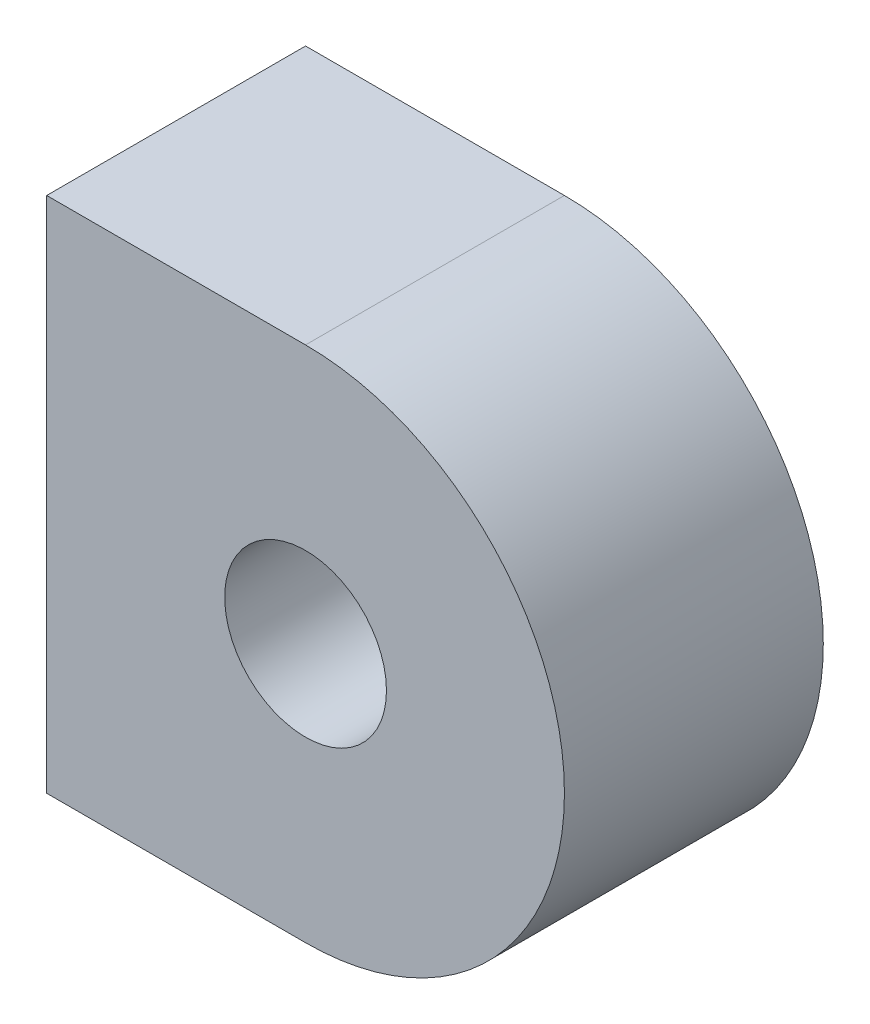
from build123d import *

# Parameters (mm, degrees)
EXTRUSION1_DEPTH           = 20
TROU_TARAUD_M14X1_51_D     = 12.5
TROU_TARAUD_M14X1_51_DEPTH = 32.5
TROU_TARAUD_M14X1_51_TIP   = 3.755378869


with BuildPart() as part:
    # Esquisse1 → Extrusion1 (new body)
    with BuildSketch(Plane.XY):
        with BuildLine():
            Line((0, 0), (20, 0))
            ThreePointArc((20, 0), (40, 20), (20, 40))
            Line((20, 40), (0, 40))
            Line((0, 40), (0, 0))
        make_face()
    extrude(amount=EXTRUSION1_DEPTH)

    # Trou taraud_ M14x1.51
    with Locations(Plane(origin=(20, 20, 20), x_dir=(1, 0, 0), z_dir=(0, 0, 1))):
        with Locations((0, 0)):
            Hole(TROU_TARAUD_M14X1_51_D / 2, depth=TROU_TARAUD_M14X1_51_DEPTH)
            with Locations((0, 0, -(TROU_TARAUD_M14X1_51_DEPTH + TROU_TARAUD_M14X1_51_TIP / 2))):  # 118° drill point
                Cone(0, TROU_TARAUD_M14X1_51_D / 2, TROU_TARAUD_M14X1_51_TIP, mode=Mode.SUBTRACT)


solid = part.part
